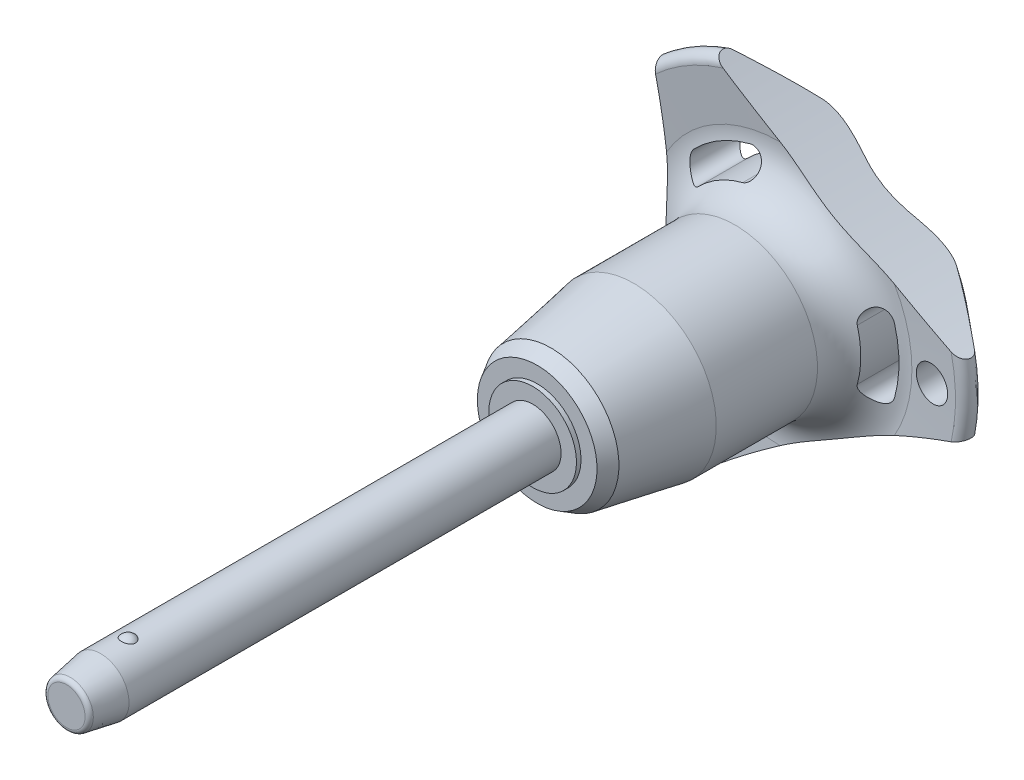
from build123d import *

# Parameters (mm, degrees)
SKETCH1_R           = 2.5
BOSS_EXTRUDE1_DEPTH = 35
SKETCH2_R           = 2.1
BOSS_EXTRUDE2_DEPTH = 26.7
BOSS_EXTRUDE3_START = 6
SKETCH1_2_R         = 2.5
BOSS_EXTRUDE3_DEPTH = 6
CHAMFER1_SIZE       = 3
CHAMFER1_SIZE2      = 0.528980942
FILLET1_R           = 0.4
SKETCH6_R           = 79.96
CUT_EXTRUDE1_DEPTH  = 67.015920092
CIRPATTERN1_COUNT   = 3
SKETCH7_R           = 1.5
CUT_EXTRUDE2_DEPTH  = 66.784951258


with BuildPart() as part:
    # Sketch1 → Boss-Extrude1 (new body)
    with BuildSketch(Plane.XY):
        Circle(SKETCH1_R)
    extrude(amount=-BOSS_EXTRUDE1_DEPTH)

    # Sketch2 → Boss-Extrude2 (add)
    with BuildSketch(Plane(origin=(0, 0, -35), x_dir=(-1, 0, 0), z_dir=(0, 0, -1))):
        Circle(SKETCH2_R)
    extrude(amount=BOSS_EXTRUDE2_DEPTH)

    # Sketch3 → Revolve1 (revolve)
    with BuildSketch(Plane(origin=(0, 0, 0), x_dir=(0, 0, -1), z_dir=(1, 0, 0))):
        with BuildLine():
            Line((-0.580947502, 2.75), (-0.580947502, 1.15))
            ThreePointArc((-0.580947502, 1.15), (0.219052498, 1.95), (-0.580947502, 2.75))
        make_face()
        with BuildLine():
            Line((-0.580947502, -1.15), (-0.580947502, -2.75))
            ThreePointArc((-0.580947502, -2.75), (0.219052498, -1.95), (-0.580947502, -1.15))
        make_face()
    revolve(axis=Axis((0, -1.15, 0.580947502), (0, 1, 0)))

    # Sketch1_2 → Boss-Extrude3 (add)
    with BuildSketch(Plane.XY.offset(BOSS_EXTRUDE3_START)):
        Circle(SKETCH1_2_R)
    extrude(amount=-BOSS_EXTRUDE3_DEPTH)

    # Chamfer1
    chamfer1_edges = [part.edges().sort_by_distance(p)[0] for p in [
        (-2.5, 0, 6),
    ]]
    chamfer1_side = [part.faces().sort_by_distance(p)[0] for p in [
        (-2.5, 0, -14.5),
    ]]
    chamfer(chamfer1_edges, length=CHAMFER1_SIZE, length2=CHAMFER1_SIZE2, reference=chamfer1_side[0])

    # Fillet1
    fillet1_edges = [part.edges().sort_by_distance(p)[0] for p in [
        (-1.971019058, 0, 6),
        (2.1, 0, -61.7),
    ]]
    fillet(fillet1_edges, radius=FILLET1_R)

    # Sketch4 → Revolve2 (revolve)
    with BuildSketch(Plane(origin=(0, 0, 0), x_dir=(0, 0, -1), z_dir=(1, 0, 0)), mode=Mode.PRIVATE) as revolve2_sk:
        Polygon((35, 0), (35, 3.851837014), (35.4, 3.851837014), (35.4, 5.26161122), (36.620900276, 5.966498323), (43.9, 7.25), (52.8, 7.25), (52.8, 0), align=None)
    revolve(revolve2_sk.sketch.rotate(Axis((0, 0, -52.8), (0, 0, 1)), 90), axis=Axis((0, 0, -52.8), (0, 0, 1)))

    # Sketch5 → Revolve3 (revolve)
    with BuildSketch(Plane(origin=(0, 0, 0), x_dir=(0, 0, -1), z_dir=(1, 0, 0)), mode=Mode.PRIVATE) as revolve3_sk:
        with BuildLine():
            Line((56.78715932, 11.570250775), (56.452568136, 15.735949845))
            ThreePointArc((56.452568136, 15.735949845), (56.946485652, 16.540188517), (57.862835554, 16.314230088))
            Line((57.862835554, 16.314230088), (61.326414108, 12.186497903))
            ThreePointArc((61.326414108, 12.186497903), (61.7, 11.109282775), (61.261488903, 10.056825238))
            ThreePointArc((61.261488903, 10.056825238), (58.289873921, 5.413681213), (57.25, 0))
            Line((57.25, 0), (52.8, 0))
            Line((52.8, 0), (52.8, 7.25))
            ThreePointArc((52.8, 7.25), (55.739473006, 8.537160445), (56.78715932, 11.570250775))
        make_face()
    revolve(revolve3_sk.sketch.rotate(Axis((0, 0, -57.25), (0, 0, 1)), 90), axis=Axis((0, 0, -57.25), (0, 0, 1)))

    # Sketch6 → Cut-Extrude1 (cut, through all)
    with BuildSketch(Plane.XY):
        with Locations((-89.76, 0)):
            Circle(SKETCH6_R)
        with BuildLine():
            ThreePointArc((10.099921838, -2.834717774), (10.490188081, 0), (10.099921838, 2.834717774))
            ThreePointArc((10.099921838, 2.834717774), (8.768180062, 3.582738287), (8.020159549, 2.250996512))
            ThreePointArc((8.020159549, 2.250996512), (8.330062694, 0), (8.020159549, -2.250996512))
            ThreePointArc((8.020159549, -2.250996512), (8.768180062, -3.582738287), (10.099921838, -2.834717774))
        make_face()
    cut_extrude1 = extrude(amount=-CUT_EXTRUDE1_DEPTH, mode=Mode.SUBTRACT)

    # CirPattern1: Cut-Extrude1 ×3 about axis
    cirpattern1_axis = Axis((0, 0, 0), (0, 0, 1))
    for i in range(1, CIRPATTERN1_COUNT):
        add(cut_extrude1.rotate(cirpattern1_axis, i * 360 / CIRPATTERN1_COUNT), mode=Mode.SUBTRACT)

    # Sketch7 → Cut-Extrude2 (cut, through all)
    with BuildSketch(Plane.XY):
        with Locations(Location((13.490188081, 0, 0), (0, 0, 225.221865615))):
            Circle(SKETCH7_R)
    extrude(amount=-CUT_EXTRUDE2_DEPTH, mode=Mode.SUBTRACT)


solid = part.part
